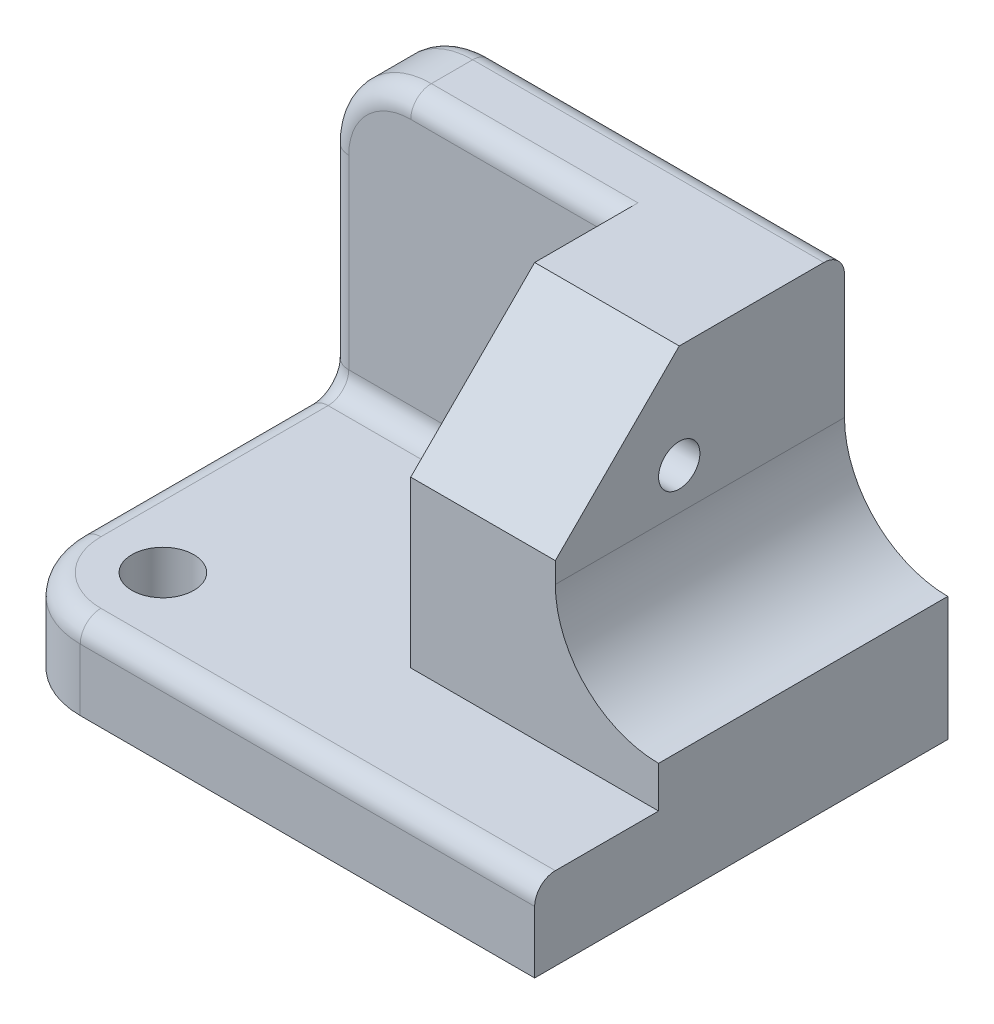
from build123d import *

# Parameters (mm, degrees)
SKETCH1_W                  = 130
SKETCH1_H                  = 100
BOSS_EXTRUDE1_DEPTH        = 20
SKETCH2_W                  = 130
SKETCH2_H                  = 20
BOSS_EXTRUDE2_DEPTH        = 70
FILLET1_R                  = 20
SKETCH3_W                  = 60
SKETCH3_H                  = 70
BOSS_EXTRUDE3_DEPTH        = 50
CUT_EXTRUDE1_DEPTH         = 132.244047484
CHAMFER1_SIZE              = 30
F_10_0_10_DIAMETER_HOLE1_D = 10
F_15_0_15_DIAMETER_HOLE1_D = 15
FILLET2_R                  = 5


with BuildPart() as part:
    # Sketch1 → Boss-Extrude1 (new body)
    with BuildSketch(Plane(origin=(0, 0, 0), x_dir=(1, 0, 0), z_dir=(0, 1, 0))):
        Rectangle(SKETCH1_W, SKETCH1_H)
    extrude(amount=BOSS_EXTRUDE1_DEPTH)

    # Sketch2 → Boss-Extrude2 (add)
    with BuildSketch(Plane(origin=(0, 20, 0), x_dir=(1, 0, 0), z_dir=(0, 1, 0))):
        with Locations((0, 40)):
            Rectangle(SKETCH2_W, SKETCH2_H)
    extrude(amount=BOSS_EXTRUDE2_DEPTH)

    # Fillet1
    fillet1_edges = [part.edges().sort_by_distance(p)[0] for p in [
        (-65, 10, 50),
        (-65, 90, -40),
    ]]
    fillet(fillet1_edges, radius=FILLET1_R)

    # Sketch3 → Boss-Extrude3 (add)
    with BuildSketch(Plane.XY.offset(-30)):
        with Locations((35, 55)):
            Rectangle(SKETCH3_W, SKETCH3_H)
    extrude(amount=BOSS_EXTRUDE3_DEPTH)

    # Sketch4 → Cut-Extrude1 (cut, through all)
    with BuildSketch(Plane.XY.offset(20)):
        with BuildLine():
            Line((40, 90), (40, 55))
            ThreePointArc((40, 55), (47.32233047, 37.32233047), (65, 30))
            Line((65, 30), (65, 90))
            Line((65, 90), (40, 90))
        make_face()
    extrude(amount=-CUT_EXTRUDE1_DEPTH, mode=Mode.SUBTRACT)

    # Chamfer1
    chamfer1_edges = [part.edges().sort_by_distance(p)[0] for p in [
        (22.5, 90, 20),
    ]]
    chamfer(chamfer1_edges, length=CHAMFER1_SIZE)

    # 10.0 _10_ Diameter Hole1 (through all)
    with Locations(Plane.ZY.offset(-5)):
        with Locations((-10, 65)):
            Hole(F_10_0_10_DIAMETER_HOLE1_D / 2)

    # 15.0 _15_ Diameter Hole1 (through all)
    with Locations(Plane(origin=(0, 20, 0), x_dir=(1, 0, 0), z_dir=(0, 1, 0))):
        with Locations((-45, -30)):
            Hole(F_15_0_15_DIAMETER_HOLE1_D / 2)

    # Fillet2
    fillet2_edges = [part.edges().sort_by_distance(p)[0] for p in [
        (-65, 20, 0),
        (10, 20, 50),
        (-65, 35, -50),
        (-2.5, 90, -50),
        (-20, 90, -30),
        (-65, 45, -30),
        (-59.142135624, 20, 44.142135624),
        (-59.142135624, 84.142135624, -50),
        (-59.142135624, 84.142135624, -30),
        (-30, 20, -30),
    ]]
    fillet(fillet2_edges, radius=FILLET2_R)


solid = part.part
